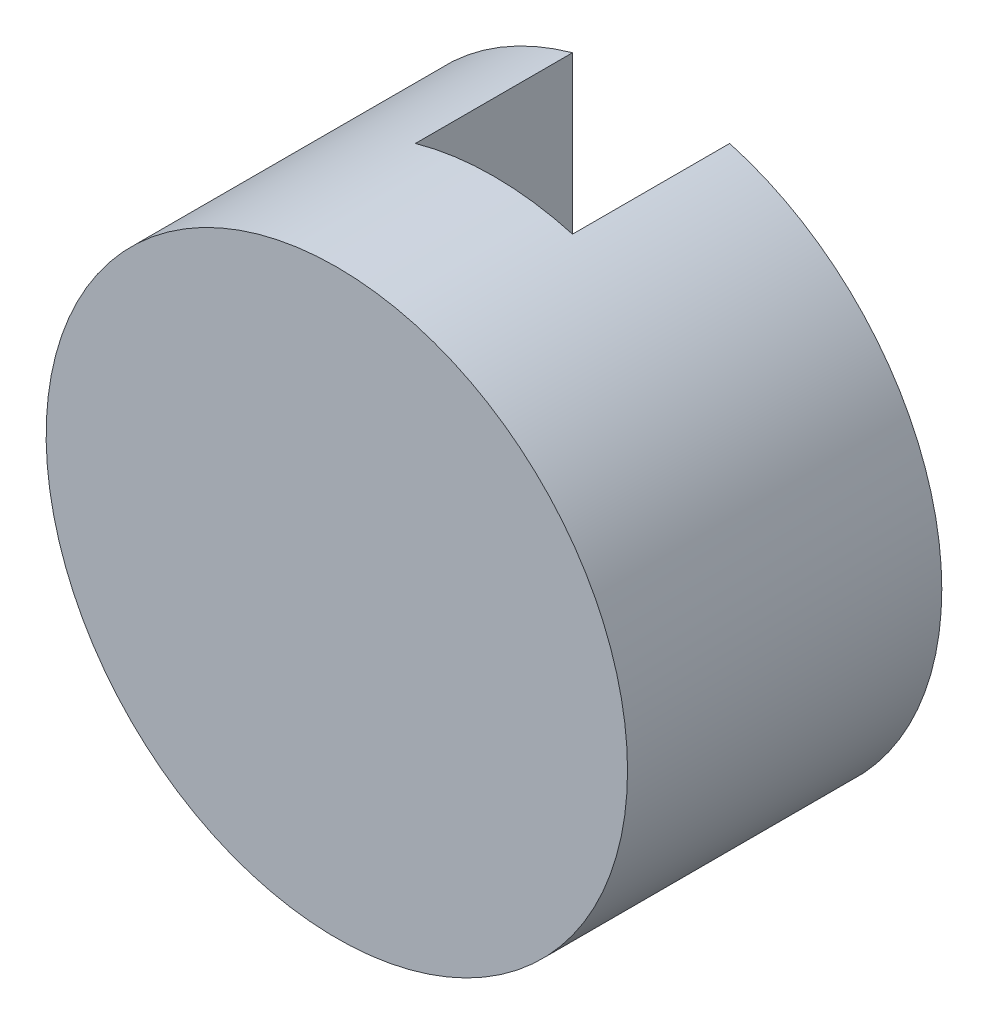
from build123d import *

# Parameters (mm, degrees)
ESBO_O1_R                = 1.85
RESSALTO_EXTRUS_O1_DEPTH = 2
ESBO_O2_W                = 1
ESBO_O2_H                = 5.130124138
CORTE_EXTRUS_O1_DEPTH    = 1


with BuildPart() as part:
    # Esbo_o1 → Ressalto-extrus_o1 (new body)
    with BuildSketch(Plane.XY):
        with Locations((-36.819348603, 12.646095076)):
            Circle(ESBO_O1_R)
    extrude(amount=RESSALTO_EXTRUS_O1_DEPTH)

    # Esbo_o2 → Corte-extrus_o1 (cut)
    with BuildSketch(Plane(origin=(0, 0, 0), x_dir=(-1, 0, 0), z_dir=(0, 0, -1))):
        with Locations((36.819348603, 12.69871976)):
            Rectangle(ESBO_O2_W, ESBO_O2_H)
    extrude(amount=-CORTE_EXTRUS_O1_DEPTH, mode=Mode.SUBTRACT)


solid = part.part
